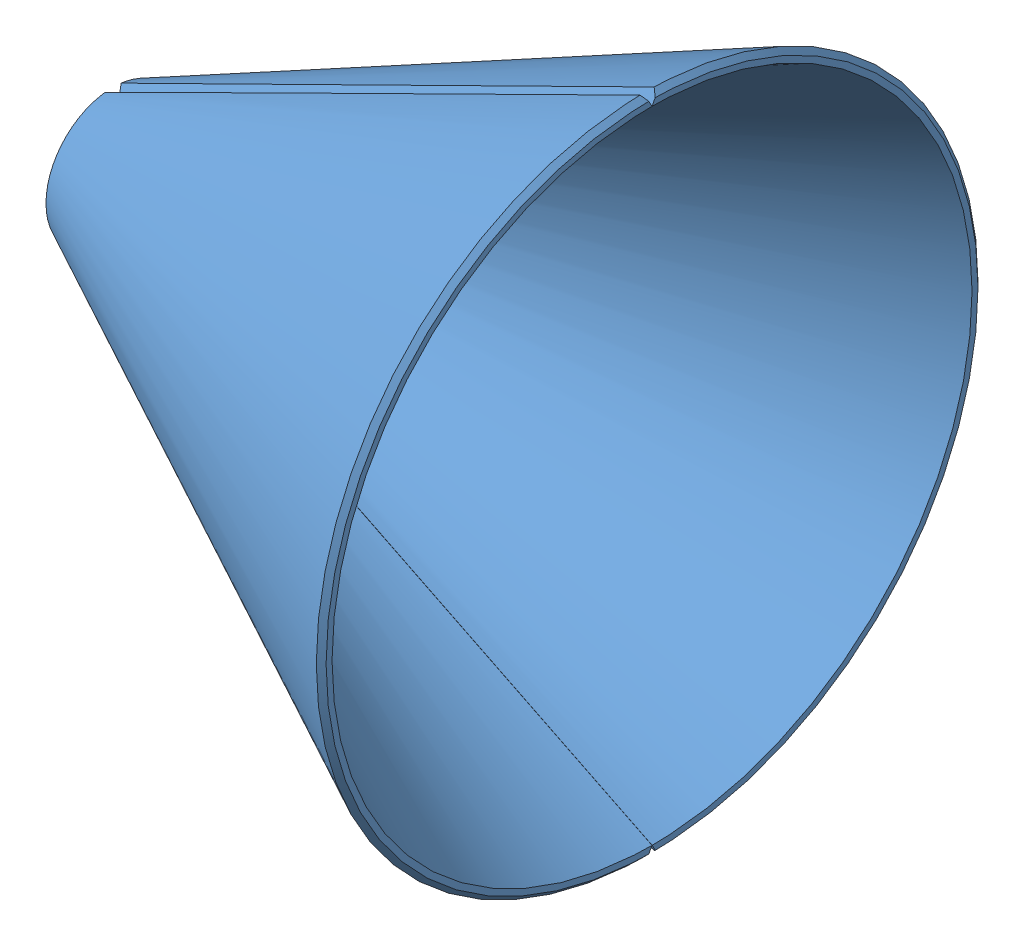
SolidWorks assembly bg_konus.SLDASM, configuration Default (file format 4100). Lengths in mm.
Overall size (181.23 222.47 222.32).
2 component instances, 1 part files, 2 mates.
Components (placement in the parent):
- halbschale_konus-1: halbschale_konus.SLDPRT [Standard<Wie bearbeitet>] at (72.3069 9.776 -55.5238) size (181.23 222.44 111.2)
- halbschale_konus-2: halbschale_konus.SLDPRT [Standard<Wie bearbeitet>] at (72.3069 9.776 -55.5238) x (1 0 0) z (0 0.000247 -1) size (181.23 222.44 111.2)
Mates (geometry in assembly coordinates):
- Deckungsgleich1: coincident aligned: axis of halbschale_konus-1 through (72.3069 9.776 -55.5238) axis (-1 0 0); axis of halbschale_konus-2 through (72.3069 9.776 -55.5238) axis (-1 0 0)
- Deckungsgleich2: coincident: point of halbschale_konus-1; point of halbschale_konus-2
